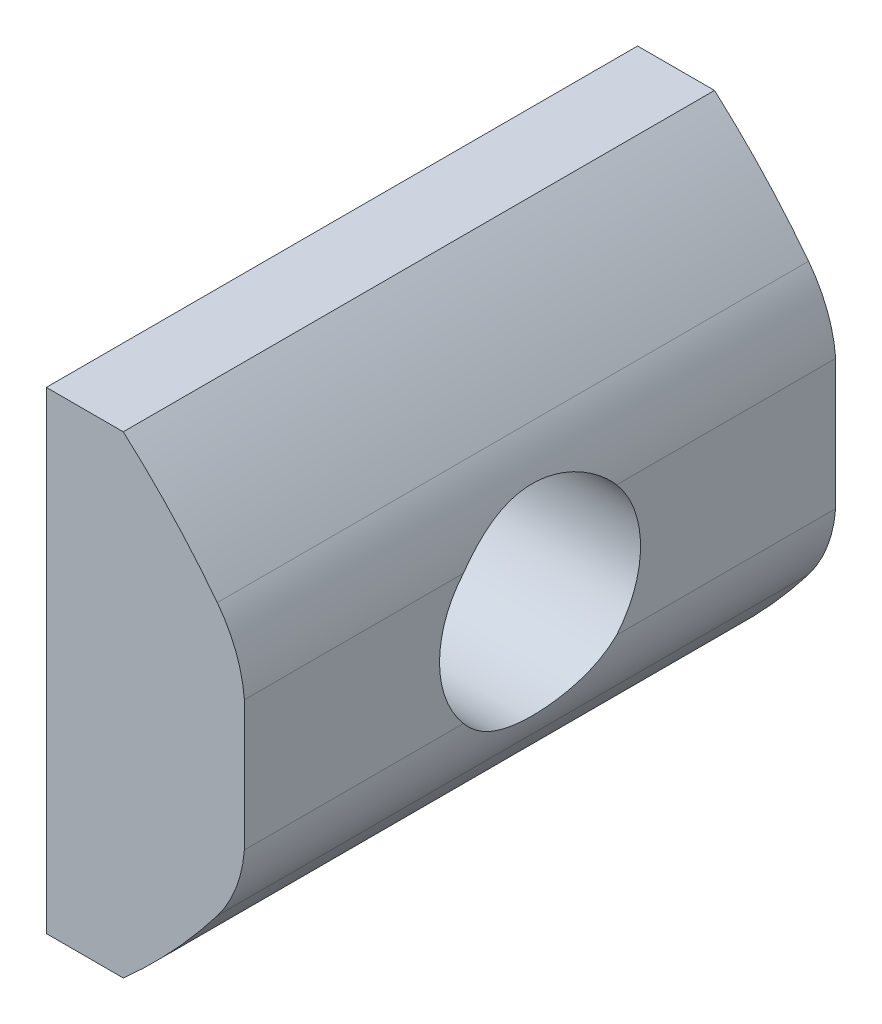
ISO-10303-21;
HEADER;
FILE_DESCRIPTION(('STEP AP214'),'2;1');
FILE_NAME('part.step','',(''),(''),'','','');
FILE_SCHEMA(('AUTOMOTIVE_DESIGN { 1 0 10303 214 1 1 1 1 }'));
ENDSEC;
DATA;
#1=APPLICATION_CONTEXT('core data for automotive mechanical design processes');
#2=APPLICATION_PROTOCOL_DEFINITION('international standard','automotive_design',2000,#1);
#3=PRODUCT_CONTEXT('',#1,'mechanical');
#4=PRODUCT('Part','Part','',(#3));
#5=PRODUCT_RELATED_PRODUCT_CATEGORY('part','',(#4));
#6=PRODUCT_DEFINITION_FORMATION('','',#4);
#7=PRODUCT_DEFINITION_CONTEXT('part definition',#1,'design');
#8=PRODUCT_DEFINITION('design','',#6,#7);
#9=PRODUCT_DEFINITION_SHAPE('','',#8);
#10=(LENGTH_UNIT() NAMED_UNIT(*) SI_UNIT(.MILLI.,.METRE.));
#11=(NAMED_UNIT(*) PLANE_ANGLE_UNIT() SI_UNIT($,.RADIAN.));
#12=(NAMED_UNIT(*) SI_UNIT($,.STERADIAN.) SOLID_ANGLE_UNIT());
#13=UNCERTAINTY_MEASURE_WITH_UNIT(LENGTH_MEASURE(1.E-05),#10,'distance_accuracy_value','');
#14=(GEOMETRIC_REPRESENTATION_CONTEXT(3) GLOBAL_UNCERTAINTY_ASSIGNED_CONTEXT((#13)) GLOBAL_UNIT_ASSIGNED_CONTEXT((#10,
#11,#12)) REPRESENTATION_CONTEXT('',''));
#15=CARTESIAN_POINT('',(0.,0.,0.));
#16=DIRECTION('',(0.,0.,1.));
#17=DIRECTION('',(1.,0.,0.));
#18=AXIS2_PLACEMENT_3D('',#15,#16,#17);
#19=CARTESIAN_POINT('',(4.,2.2,10.));
#20=DIRECTION('',(-1.,0.,0.));
#21=DIRECTION('',(0.,0.,1.));
#22=AXIS2_PLACEMENT_3D('',#19,#20,#21);
#23=PLANE('',#22);
#24=DIRECTION('',(0.,0.,-1.));
#25=VECTOR('',#24,1.);
#26=CARTESIAN_POINT('',(4.,2.2,10.));
#27=LINE('',#26,#25);
#28=CARTESIAN_POINT('',(4.,2.2,-2.59229627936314));
#29=VERTEX_POINT('',#28);
#30=CARTESIAN_POINT('',(4.,2.2,-10.));
#31=VERTEX_POINT('',#30);
#32=EDGE_CURVE('E144',#29,#31,#27,.T.);
#33=ORIENTED_EDGE('',*,*,#32,.F.);
#34=CARTESIAN_POINT('',(4.,0.,0.));
#35=DIRECTION('',(-1.,0.,0.));
#36=DIRECTION('',(0.,0.,1.));
#37=AXIS2_PLACEMENT_3D('',#34,#35,#36);
#38=CIRCLE('',#37,3.4);
#39=CARTESIAN_POINT('',(4.,-2.20000000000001,-2.59229627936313));
#40=VERTEX_POINT('',#39);
#41=EDGE_CURVE('E51',#29,#40,#38,.T.);
#42=ORIENTED_EDGE('',*,*,#41,.T.);
#43=DIRECTION('',(0.,0.,-1.));
#44=VECTOR('',#43,1.);
#45=CARTESIAN_POINT('',(4.,-2.2,10.));
#46=LINE('',#45,#44);
#47=CARTESIAN_POINT('',(4.,-2.2,-10.));
#48=VERTEX_POINT('',#47);
#49=EDGE_CURVE('E143',#40,#48,#46,.T.);
#50=ORIENTED_EDGE('',*,*,#49,.T.);
#51=DIRECTION('',(0.,1.,0.));
#52=VECTOR('',#51,1.);
#53=CARTESIAN_POINT('',(4.,2.2,-10.));
#54=LINE('',#53,#52);
#55=EDGE_CURVE('E221',#48,#31,#54,.T.);
#56=ORIENTED_EDGE('',*,*,#55,.T.);
#57=EDGE_LOOP('',(#33,#42,#50,#56));
#58=FACE_BOUND('',#57,.T.);
#59=ADVANCED_FACE('F31',(#58),#23,.F.);
#60=CARTESIAN_POINT('',(-3.,8.,10.));
#61=DIRECTION('',(0.,-1.,0.));
#62=DIRECTION('',(0.,0.,-1.));
#63=AXIS2_PLACEMENT_3D('',#60,#61,#62);
#64=PLANE('',#63);
#65=DIRECTION('',(-1.,0.,0.));
#66=VECTOR('',#65,1.);
#67=CARTESIAN_POINT('',(-3.,8.,-10.));
#68=LINE('',#67,#66);
#69=CARTESIAN_POINT('',(-0.0973372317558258,8.,-10.));
#70=VERTEX_POINT('',#69);
#71=CARTESIAN_POINT('',(-2.7,8.,-10.));
#72=VERTEX_POINT('',#71);
#73=EDGE_CURVE('E177',#70,#72,#68,.T.);
#74=ORIENTED_EDGE('',*,*,#73,.T.);
#75=DIRECTION('',(0.,0.,1.));
#76=VECTOR('',#75,1.);
#77=CARTESIAN_POINT('',(-2.7,8.,10.));
#78=LINE('',#77,#76);
#79=CARTESIAN_POINT('',(-2.7,8.,10.));
#80=VERTEX_POINT('',#79);
#81=EDGE_CURVE('E166',#72,#80,#78,.T.);
#82=ORIENTED_EDGE('',*,*,#81,.T.);
#83=DIRECTION('',(-1.,0.,0.));
#84=VECTOR('',#83,1.);
#85=CARTESIAN_POINT('',(-3.,8.,10.));
#86=LINE('',#85,#84);
#87=CARTESIAN_POINT('',(-0.0973372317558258,8.,10.));
#88=VERTEX_POINT('',#87);
#89=EDGE_CURVE('E228',#88,#80,#86,.T.);
#90=ORIENTED_EDGE('',*,*,#89,.F.);
#91=DIRECTION('',(0.,0.,-1.));
#92=VECTOR('',#91,1.);
#93=CARTESIAN_POINT('',(-0.0973372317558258,8.,10.));
#94=LINE('',#93,#92);
#95=EDGE_CURVE('E190',#88,#70,#94,.T.);
#96=ORIENTED_EDGE('',*,*,#95,.T.);
#97=EDGE_LOOP('',(#74,#82,#90,#96));
#98=FACE_BOUND('',#97,.T.);
#99=ADVANCED_FACE('F33',(#98),#64,.F.);
#100=CARTESIAN_POINT('',(-3.,8.,10.));
#101=DIRECTION('',(1.,0.,0.));
#102=DIRECTION('',(0.,0.,-1.));
#103=AXIS2_PLACEMENT_3D('',#100,#101,#102);
#104=PLANE('',#103);
#105=CARTESIAN_POINT('',(-3.,0.,0.));
#106=DIRECTION('',(-1.,0.,0.));
#107=DIRECTION('',(0.,0.,1.));
#108=AXIS2_PLACEMENT_3D('',#105,#106,#107);
#109=CIRCLE('',#108,3.39999999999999);
#110=CARTESIAN_POINT('',(-3.,0.,3.39999999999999));
#111=VERTEX_POINT('',#110);
#112=EDGE_CURVE('E138',#111,#111,#109,.T.);
#113=ORIENTED_EDGE('',*,*,#112,.F.);
#114=EDGE_LOOP('',(#113));
#115=FACE_BOUND('',#114,.T.);
#116=DIRECTION('',(0.,1.,0.));
#117=VECTOR('',#116,1.);
#118=CARTESIAN_POINT('',(-3.,8.,9.7));
#119=LINE('',#118,#117);
#120=CARTESIAN_POINT('',(-3.,-7.7,9.7));
#121=VERTEX_POINT('',#120);
#122=CARTESIAN_POINT('',(-3.,7.7,9.7));
#123=VERTEX_POINT('',#122);
#124=EDGE_CURVE('E161',#121,#123,#119,.T.);
#125=ORIENTED_EDGE('',*,*,#124,.T.);
#126=DIRECTION('',(0.,0.,-1.));
#127=VECTOR('',#126,1.);
#128=CARTESIAN_POINT('',(-3.,7.7,10.));
#129=LINE('',#128,#127);
#130=CARTESIAN_POINT('',(-3.,7.7,-9.7));
#131=VERTEX_POINT('',#130);
#132=EDGE_CURVE('E163',#123,#131,#129,.T.);
#133=ORIENTED_EDGE('',*,*,#132,.T.);
#134=DIRECTION('',(0.,-1.,0.));
#135=VECTOR('',#134,1.);
#136=CARTESIAN_POINT('',(-3.,8.,-9.7));
#137=LINE('',#136,#135);
#138=CARTESIAN_POINT('',(-3.,-7.7,-9.7));
#139=VERTEX_POINT('',#138);
#140=EDGE_CURVE('E157',#131,#139,#137,.T.);
#141=ORIENTED_EDGE('',*,*,#140,.T.);
#142=DIRECTION('',(0.,0.,1.));
#143=VECTOR('',#142,1.);
#144=CARTESIAN_POINT('',(-3.,-7.7,10.));
#145=LINE('',#144,#143);
#146=EDGE_CURVE('E159',#139,#121,#145,.T.);
#147=ORIENTED_EDGE('',*,*,#146,.T.);
#148=EDGE_LOOP('',(#125,#133,#141,#147));
#149=FACE_BOUND('',#148,.T.);
#150=ADVANCED_FACE('F267',(#115,#149),#104,.F.);
#151=CARTESIAN_POINT('',(-3.,-8.,10.));
#152=DIRECTION('',(0.,1.,0.));
#153=DIRECTION('',(0.,0.,1.));
#154=AXIS2_PLACEMENT_3D('',#151,#152,#153);
#155=PLANE('',#154);
#156=DIRECTION('',(1.,0.,0.));
#157=VECTOR('',#156,1.);
#158=CARTESIAN_POINT('',(-3.,-8.,10.));
#159=LINE('',#158,#157);
#160=CARTESIAN_POINT('',(-2.7,-8.,10.));
#161=VERTEX_POINT('',#160);
#162=CARTESIAN_POINT('',(-0.0973372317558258,-8.,10.));
#163=VERTEX_POINT('',#162);
#164=EDGE_CURVE('E230',#161,#163,#159,.T.);
#165=ORIENTED_EDGE('',*,*,#164,.F.);
#166=DIRECTION('',(0.,0.,-1.));
#167=VECTOR('',#166,1.);
#168=CARTESIAN_POINT('',(-2.7,-8.,10.));
#169=LINE('',#168,#167);
#170=CARTESIAN_POINT('',(-2.7,-8.,-10.));
#171=VERTEX_POINT('',#170);
#172=EDGE_CURVE('E58',#161,#171,#169,.T.);
#173=ORIENTED_EDGE('',*,*,#172,.T.);
#174=DIRECTION('',(1.,0.,0.));
#175=VECTOR('',#174,1.);
#176=CARTESIAN_POINT('',(-3.,-8.,-10.));
#177=LINE('',#176,#175);
#178=CARTESIAN_POINT('',(-0.0973372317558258,-8.,-10.));
#179=VERTEX_POINT('',#178);
#180=EDGE_CURVE('E179',#171,#179,#177,.T.);
#181=ORIENTED_EDGE('',*,*,#180,.T.);
#182=DIRECTION('',(0.,0.,-1.));
#183=VECTOR('',#182,1.);
#184=CARTESIAN_POINT('',(-0.0973372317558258,-8.,10.));
#185=LINE('',#184,#183);
#186=EDGE_CURVE('E154',#163,#179,#185,.T.);
#187=ORIENTED_EDGE('',*,*,#186,.F.);
#188=EDGE_LOOP('',(#165,#173,#181,#187));
#189=FACE_BOUND('',#188,.T.);
#190=ADVANCED_FACE('F257',(#189),#155,.F.);
#191=CARTESIAN_POINT('',(-16.3500000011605,10.3330562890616,10.));
#192=DIRECTION('',(0.,0.,-1.));
#193=DIRECTION('',(-1.,0.,0.));
#194=AXIS2_PLACEMENT_3D('',#191,#192,#193);
#195=CYLINDRICAL_SURFACE('',#194,24.4999999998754);
#196=CARTESIAN_POINT('',(-16.3500000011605,10.3330562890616,-10.));
#197=DIRECTION('',(0.,0.,1.));
#198=DIRECTION('',(-1.,0.,0.));
#199=AXIS2_PLACEMENT_3D('',#196,#197,#198);
#200=CIRCLE('',#199,24.4999999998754);
#201=CARTESIAN_POINT('',(3.08330765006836,-4.58661373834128,-10.));
#202=VERTEX_POINT('',#201);
#203=EDGE_CURVE('E216',#179,#202,#200,.T.);
#204=ORIENTED_EDGE('',*,*,#203,.T.);
#205=DIRECTION('',(0.,0.,-1.));
#206=VECTOR('',#205,1.);
#207=CARTESIAN_POINT('',(3.08330765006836,-4.58661373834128,10.));
#208=LINE('',#207,#206);
#209=CARTESIAN_POINT('',(3.08330765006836,-4.58661373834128,10.));
#210=VERTEX_POINT('',#209);
#211=EDGE_CURVE('E151',#210,#202,#208,.T.);
#212=ORIENTED_EDGE('',*,*,#211,.F.);
#213=CARTESIAN_POINT('',(-16.3500000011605,10.3330562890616,10.));
#214=DIRECTION('',(0.,0.,1.));
#215=DIRECTION('',(-1.,0.,0.));
#216=AXIS2_PLACEMENT_3D('',#213,#214,#215);
#217=CIRCLE('',#216,24.4999999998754);
#218=EDGE_CURVE('E232',#163,#210,#217,.T.);
#219=ORIENTED_EDGE('',*,*,#218,.F.);
#220=ORIENTED_EDGE('',*,*,#186,.T.);
#221=EDGE_LOOP('',(#204,#212,#219,#220));
#222=FACE_BOUND('',#221,.T.);
#223=ADVANCED_FACE('F254',(#222),#195,.T.);
#224=CARTESIAN_POINT('',(-0.486075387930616,-1.84626618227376,10.));
#225=DIRECTION('',(0.,0.,-1.));
#226=DIRECTION('',(-1.,0.,0.));
#227=AXIS2_PLACEMENT_3D('',#224,#225,#226);
#228=CYLINDRICAL_SURFACE('',#227,4.5);
#229=ORIENTED_EDGE('',*,*,#49,.F.);
#230=CARTESIAN_POINT('',(-3.71669234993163,1.28632284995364,-3.14728033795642));
#231=CARTESIAN_POINT('',(-3.62037329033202,1.38562200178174,-3.10669729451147));
#232=CARTESIAN_POINT('',(-3.52027985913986,1.47971882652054,-3.06275604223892));
#233=CARTESIAN_POINT('',(-3.31321734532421,1.65743533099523,-2.97034132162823));
#234=CARTESIAN_POINT('',(-3.20625227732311,1.74106104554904,-2.92187049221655));
#235=CARTESIAN_POINT('',(-2.9848454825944,1.89870461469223,-2.82200509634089));
#236=CARTESIAN_POINT('',(-2.87033681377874,1.97261186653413,-2.77058509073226));
#237=CARTESIAN_POINT('',(-2.63516193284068,2.10973558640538,-2.66765352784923));
#238=CARTESIAN_POINT('',(-2.51449597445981,2.17295249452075,-2.61614197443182));
#239=CARTESIAN_POINT('',(-2.20617777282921,2.31700431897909,-2.49087829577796));
#240=CARTESIAN_POINT('',(-2.01474384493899,2.39123348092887,-2.4186345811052));
#241=CARTESIAN_POINT('',(-1.6190398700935,2.51365890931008,-2.29114569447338));
#242=CARTESIAN_POINT('',(-1.41483937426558,2.5619844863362,-2.23581669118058));
#243=CARTESIAN_POINT('',(-1.04483478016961,2.62184778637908,-2.16509013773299));
#244=CARTESIAN_POINT('',(-0.881299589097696,2.63936555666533,-2.14336059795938));
#245=CARTESIAN_POINT('',(-0.634405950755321,2.65204720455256,-2.12759476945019));
#246=CARTESIAN_POINT('',(-0.551860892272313,2.65400962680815,-2.12514295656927));
#247=CARTESIAN_POINT('',(-0.386812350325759,2.65339574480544,-2.12590964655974));
#248=CARTESIAN_POINT('',(-0.304308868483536,2.65081927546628,-2.12912835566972));
#249=CARTESIAN_POINT('',(-0.0583578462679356,2.63635494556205,-2.14707377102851));
#250=CARTESIAN_POINT('',(0.104169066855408,2.61776415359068,-2.17005075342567));
#251=CARTESIAN_POINT('',(0.423095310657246,2.56392204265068,-2.23337151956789));
#252=CARTESIAN_POINT('',(0.579477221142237,2.52862660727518,-2.27376126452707));
#253=CARTESIAN_POINT('',(0.854232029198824,2.45137367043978,-2.3565464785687));
#254=CARTESIAN_POINT('',(0.97399937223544,2.41211944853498,-2.39696096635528));
#255=CARTESIAN_POINT('',(1.20853548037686,2.3243432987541,-2.48217017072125));
#256=CARTESIAN_POINT('',(1.32330131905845,2.27581603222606,-2.52696740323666));
#257=CARTESIAN_POINT('',(1.54803769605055,2.16968492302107,-2.6186638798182));
#258=CARTESIAN_POINT('',(1.6579961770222,2.11205976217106,-2.66556787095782));
#259=CARTESIAN_POINT('',(1.87276732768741,1.98795322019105,-2.75936471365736));
#260=CARTESIAN_POINT('',(1.97758101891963,1.92147360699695,-2.80625756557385));
#261=CARTESIAN_POINT('',(2.18564710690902,1.77706324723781,-2.89995263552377));
#262=CARTESIAN_POINT('',(2.28870059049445,1.69880147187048,-2.9466881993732));
#263=CARTESIAN_POINT('',(2.48866870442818,1.53275592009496,-3.03637429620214));
#264=CARTESIAN_POINT('',(2.58558200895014,1.44497009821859,-3.0793240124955));
#265=CARTESIAN_POINT('',(2.77225060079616,1.26025578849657,-3.15940607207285));
#266=CARTESIAN_POINT('',(2.86202873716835,1.1633588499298,-3.19655738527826));
#267=CARTESIAN_POINT('',(3.03377785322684,0.960564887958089,-3.26323734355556));
#268=CARTESIAN_POINT('',(3.11575404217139,0.854673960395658,-3.29277109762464));
#269=CARTESIAN_POINT('',(3.29260250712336,0.603471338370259,-3.34912461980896));
#270=CARTESIAN_POINT('',(3.38467517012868,0.455413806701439,-3.37287860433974));
#271=CARTESIAN_POINT('',(3.5098122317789,0.225101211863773,-3.3934194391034));
#272=CARTESIAN_POINT('',(3.5493697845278,0.146941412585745,-3.39775066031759));
#273=CARTESIAN_POINT('',(3.62388600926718,-0.0116347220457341,-3.40090303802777));
#274=CARTESIAN_POINT('',(3.65884683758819,-0.0920499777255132,-3.39972678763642));
#275=CARTESIAN_POINT('',(3.72415212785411,-0.25511644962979,-3.39140535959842));
#276=CARTESIAN_POINT('',(3.75446117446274,-0.337779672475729,-3.38421684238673));
#277=CARTESIAN_POINT('',(3.80996446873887,-0.503987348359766,-3.36348115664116));
#278=CARTESIAN_POINT('',(3.83516098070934,-0.587531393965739,-3.34993681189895));
#279=CARTESIAN_POINT('',(3.88038418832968,-0.754694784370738,-3.316278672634));
#280=CARTESIAN_POINT('',(3.90041107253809,-0.838314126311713,-3.29616511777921));
#281=CARTESIAN_POINT('',(3.93535895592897,-1.00475044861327,-3.24929995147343));
#282=CARTESIAN_POINT('',(3.95028034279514,-1.08756748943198,-3.22254884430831));
#283=CARTESIAN_POINT('',(3.97396573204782,-1.24327745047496,-3.1655055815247));
#284=CARTESIAN_POINT('',(3.98319844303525,-1.31632998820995,-3.13584119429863));
#285=CARTESIAN_POINT('',(3.99794694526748,-1.46051257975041,-3.07134378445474));
#286=CARTESIAN_POINT('',(4.0034614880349,-1.53164198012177,-3.03650903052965));
#287=CARTESIAN_POINT('',(4.01486901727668,-1.74127302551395,-2.92455007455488));
#288=CARTESIAN_POINT('',(4.01564457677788,-1.87614870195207,-2.8399232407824));
#289=CARTESIAN_POINT('',(4.00652580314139,-2.13607721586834,-2.65025592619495));
#290=CARTESIAN_POINT('',(3.99632513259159,-2.2607379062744,-2.54470004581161));
#291=CARTESIAN_POINT('',(3.96870438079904,-2.49330681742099,-2.31730147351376));
#292=CARTESIAN_POINT('',(3.95128063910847,-2.60120650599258,-2.19545054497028));
#293=CARTESIAN_POINT('',(3.91088560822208,-2.81033590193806,-1.9222675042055));
#294=CARTESIAN_POINT('',(3.88749725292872,-2.90915601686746,-1.76915225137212));
#295=CARTESIAN_POINT('',(3.84206984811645,-3.08122447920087,-1.44881939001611));
#296=CARTESIAN_POINT('',(3.82003127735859,-3.15446379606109,-1.28159682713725));
#297=CARTESIAN_POINT('',(3.7910254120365,-3.24536470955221,-1.01829542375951));
#298=CARTESIAN_POINT('',(3.78184705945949,-3.2729595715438,-0.925781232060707));
#299=CARTESIAN_POINT('',(3.76576008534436,-3.32021495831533,-0.738565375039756));
#300=CARTESIAN_POINT('',(3.7588505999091,-3.3398785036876,-0.643864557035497));
#301=CARTESIAN_POINT('',(3.74774538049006,-3.37107289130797,-0.453008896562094));
#302=CARTESIAN_POINT('',(3.74354877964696,-3.38260633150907,-0.356854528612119));
#303=CARTESIAN_POINT('',(3.73813521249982,-3.39742950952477,-0.163831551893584));
#304=CARTESIAN_POINT('',(3.73691805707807,-3.40071977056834,-0.0669629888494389));
#305=CARTESIAN_POINT('',(3.73752731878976,-3.39906432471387,0.121409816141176));
#306=CARTESIAN_POINT('',(3.73919135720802,-3.39455802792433,0.212918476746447));
#307=CARTESIAN_POINT('',(3.74514863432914,-3.37819574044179,0.395198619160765));
#308=CARTESIAN_POINT('',(3.74944277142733,-3.36633723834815,0.48596983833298));
#309=CARTESIAN_POINT('',(3.76594174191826,-3.3198709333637,0.756160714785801));
#310=CARTESIAN_POINT('',(3.78176424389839,-3.27437076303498,0.933611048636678));
#311=CARTESIAN_POINT('',(3.81955128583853,-3.15598479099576,1.27784261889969));
#312=CARTESIAN_POINT('',(3.8415026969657,-3.08315741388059,1.44464573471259));
#313=CARTESIAN_POINT('',(3.88680736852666,-2.91197807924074,1.76445857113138));
#314=CARTESIAN_POINT('',(3.91016132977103,-2.81361327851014,1.91746129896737));
#315=CARTESIAN_POINT('',(3.95416204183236,-2.58677182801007,2.21484388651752));
#316=CARTESIAN_POINT('',(3.97456738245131,-2.45685966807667,2.35818049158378));
#317=CARTESIAN_POINT('',(3.99680440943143,-2.24483725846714,2.55539977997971));
#318=CARTESIAN_POINT('',(4.00282230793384,-2.17127168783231,2.61819652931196));
#319=CARTESIAN_POINT('',(4.01125605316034,-2.01894120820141,2.73737215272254));
#320=CARTESIAN_POINT('',(4.01367395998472,-1.94017929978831,2.79375468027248));
#321=CARTESIAN_POINT('',(4.01412577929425,-1.78251661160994,2.8967252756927));
#322=CARTESIAN_POINT('',(4.01239025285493,-1.70385484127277,2.94367861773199));
#323=CARTESIAN_POINT('',(4.00442761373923,-1.54320838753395,3.03098291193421));
#324=CARTESIAN_POINT('',(3.99820289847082,-1.46122549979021,3.07133737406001));
#325=CARTESIAN_POINT('',(3.98078615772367,-1.2947729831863,3.1451304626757));
#326=CARTESIAN_POINT('',(3.96959732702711,-1.21030498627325,3.1785735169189));
#327=CARTESIAN_POINT('',(3.9419036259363,-1.03975312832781,3.23837579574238));
#328=CARTESIAN_POINT('',(3.92539935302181,-0.953669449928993,3.2647358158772));
#329=CARTESIAN_POINT('',(3.88920352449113,-0.791281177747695,3.30757454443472));
#330=CARTESIAN_POINT('',(3.87013647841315,-0.715049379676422,3.32486158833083));
#331=CARTESIAN_POINT('',(3.82771742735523,-0.562732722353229,3.35400604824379));
#332=CARTESIAN_POINT('',(3.80436409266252,-0.486647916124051,3.36586177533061));
#333=CARTESIAN_POINT('',(3.72794599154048,-0.259631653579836,3.39348706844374));
#334=CARTESIAN_POINT('',(3.66848945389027,-0.109785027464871,3.4013540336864));
#335=CARTESIAN_POINT('',(3.5339756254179,0.182309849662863,3.39825920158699));
#336=CARTESIAN_POINT('',(3.45891843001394,0.324558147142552,3.38729751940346));
#337=CARTESIAN_POINT('',(3.2951478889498,0.598705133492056,3.34973334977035));
#338=CARTESIAN_POINT('',(3.20642750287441,0.730598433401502,3.32312277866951));
#339=CARTESIAN_POINT('',(2.97188150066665,1.04282049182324,3.24185163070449));
#340=CARTESIAN_POINT('',(2.81908820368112,1.21600545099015,3.17985797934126));
#341=CARTESIAN_POINT('',(2.49295546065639,1.53420238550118,3.03917386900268));
#342=CARTESIAN_POINT('',(2.31956927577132,1.67914822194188,2.96044509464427));
#343=CARTESIAN_POINT('',(2.04440947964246,1.87660784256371,2.83629913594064));
#344=CARTESIAN_POINT('',(1.94893122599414,1.93973487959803,2.79335301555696));
#345=CARTESIAN_POINT('',(1.75359623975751,2.05846635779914,2.70704577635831));
#346=CARTESIAN_POINT('',(1.653740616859,2.11407269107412,2.66368476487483));
#347=CARTESIAN_POINT('',(1.44972888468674,2.21769051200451,2.57805421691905));
#348=CARTESIAN_POINT('',(1.3455735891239,2.26570342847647,2.53578447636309));
#349=CARTESIAN_POINT('',(1.13300571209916,2.35395176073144,2.45408385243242));
#350=CARTESIAN_POINT('',(1.0245943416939,2.39418936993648,2.41465217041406));
#351=CARTESIAN_POINT('',(0.74925426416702,2.48431613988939,2.32252195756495));
#352=CARTESIAN_POINT('',(0.579614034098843,2.52931574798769,2.2727542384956));
#353=CARTESIAN_POINT('',(0.319172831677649,2.58198451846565,2.21225577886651));
#354=CARTESIAN_POINT('',(0.231457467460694,2.59706092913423,2.19445975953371));
#355=CARTESIAN_POINT('',(0.0543585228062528,2.62205748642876,2.16453129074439));
#356=CARTESIAN_POINT('',(-0.0350240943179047,2.63198052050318,2.15239567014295));
#357=CARTESIAN_POINT('',(-0.215849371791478,2.64653833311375,2.13447251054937));
#358=CARTESIAN_POINT('',(-0.307303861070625,2.65111457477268,2.12875526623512));
#359=CARTESIAN_POINT('',(-0.49048945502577,2.65466398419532,2.12432760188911));
#360=CARTESIAN_POINT('',(-0.582220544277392,2.65363745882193,2.1256167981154));
#361=CARTESIAN_POINT('',(-0.765197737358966,2.64600312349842,2.1351119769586));
#362=CARTESIAN_POINT('',(-0.85644312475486,2.63938859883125,2.14332628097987));
#363=CARTESIAN_POINT('',(-1.03759534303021,2.6207391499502,2.16608853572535));
#364=CARTESIAN_POINT('',(-1.1275013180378,2.60870090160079,2.18064037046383));
#365=CARTESIAN_POINT('',(-1.43024998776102,2.55889023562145,2.23942870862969));
#366=CARTESIAN_POINT('',(-1.63867745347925,2.50870423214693,2.29667541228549));
#367=CARTESIAN_POINT('',(-1.94049992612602,2.41353485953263,2.3951923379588));
#368=CARTESIAN_POINT('',(-2.03949578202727,2.37840423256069,2.43022388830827));
#369=CARTESIAN_POINT('',(-2.23397115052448,2.30171600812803,2.50297735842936));
#370=CARTESIAN_POINT('',(-2.32945149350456,2.26015994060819,2.54069863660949));
#371=CARTESIAN_POINT('',(-2.52154997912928,2.16854805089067,2.61939380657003));
#372=CARTESIAN_POINT('',(-2.61798635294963,2.11817115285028,2.66043602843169));
#373=CARTESIAN_POINT('',(-2.80693455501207,2.01060316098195,2.742639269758));
#374=CARTESIAN_POINT('',(-2.89944487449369,1.95340947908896,2.78380032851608));
#375=CARTESIAN_POINT('',(-3.17033409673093,1.77199877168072,2.90535810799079));
#376=CARTESIAN_POINT('',(-3.34288594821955,1.63756380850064,2.98418338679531));
#377=CARTESIAN_POINT('',(-3.54208178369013,1.4572451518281,3.07209392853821));
#378=CARTESIAN_POINT('',(-3.57766078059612,1.42397608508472,3.0876654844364));
#379=CARTESIAN_POINT('',(-3.64788336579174,1.35613176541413,3.11805770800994));
#380=CARTESIAN_POINT('',(-3.68252692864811,1.3215564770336,3.13287835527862));
#381=CARTESIAN_POINT('',(-3.71669234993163,1.28632284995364,3.14728033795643));
#382=B_SPLINE_CURVE_WITH_KNOTS('',3,(#230,#231,#232,#233,#234,#235,#236,#237,#238,#239,#240,
#241,#242,#243,#244,#245,#246,#247,#248,#249,#250,#251,#252,#253,#254,#255,#256,#257,#258,#259,
#260,#261,#262,#263,#264,#265,#266,#267,#268,#269,#270,#271,#272,#273,#274,#275,#276,#277,#278,
#279,#280,#281,#282,#283,#284,#285,#286,#287,#288,#289,#290,#291,#292,#293,#294,#295,#296,#297,
#298,#299,#300,#301,#302,#303,#304,#305,#306,#307,#308,#309,#310,#311,#312,#313,#314,#315,#316,
#317,#318,#319,#320,#321,#322,#323,#324,#325,#326,#327,#328,#329,#330,#331,#332,#333,#334,#335,
#336,#337,#338,#339,#340,#341,#342,#343,#344,#345,#346,#347,#348,#349,#350,#351,#352,#353,#354,
#355,#356,#357,#358,#359,#360,#361,#362,#363,#364,#365,#366,#367,#368,#369,#370,#371,#372,#373,
#374,#375,#376,#377,#378,#379,#380,#381),.UNSPECIFIED.,.F.,.F.,(4,2,2,2,2,2,2,2,2,2,2,2,2,2,2,2,
2,2,2,2,2,2,2,2,2,2,2,2,2,2,2,2,2,2,2,2,2,2,2,2,2,2,2,2,2,2,2,2,2,2,2,2,2,2,2,2,2,2,2,2,2,2,2,2,
2,2,2,2,2,2,2,2,2,2,2,4),(0.,0.432157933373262,0.864065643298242,1.30052739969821,
1.73697118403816,2.38786389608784,3.0354763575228,3.53073034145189,3.77825065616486,
4.02577997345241,4.51894338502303,5.01341655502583,5.409972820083,5.8067580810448,
6.20448727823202,6.60213718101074,7.01439978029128,7.42675109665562,7.83772374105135,
8.2484200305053,8.77390679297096,9.03676447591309,9.29949840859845,9.56414275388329,
9.82866963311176,10.093186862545,10.3576840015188,10.5955487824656,10.8334933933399,
11.3089650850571,11.7980594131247,12.2874019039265,12.8362938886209,13.3853794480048,
13.6759950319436,13.9664998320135,14.2569117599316,14.5473052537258,14.8218604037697,
15.0965093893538,15.6453529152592,16.1930296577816,16.7409823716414,17.3213033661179,
17.6116930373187,17.901916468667,18.1764061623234,18.4507493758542,18.7249162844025,
18.9990523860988,19.2401246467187,19.481271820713,19.9630870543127,20.4448993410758,
20.9269607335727,21.6404399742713,22.3555706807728,22.7220738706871,23.0884846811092,
23.4548264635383,23.8210647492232,24.3662393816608,24.6382563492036,24.9101207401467,
25.1849344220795,25.4597330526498,25.7348623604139,26.0101605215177,26.6715395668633,
27.0035913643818,27.3355642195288,27.684134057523,28.0328366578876,28.7273544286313,
28.8807542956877,29.0341583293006),.UNSPECIFIED.);
#383=CARTESIAN_POINT('',(4.,-2.20000000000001,2.59229627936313));
#384=VERTEX_POINT('',#383);
#385=EDGE_CURVE('E202',#40,#384,#382,.T.);
#386=ORIENTED_EDGE('',*,*,#385,.T.);
#387=CARTESIAN_POINT('',(4.,-2.2,10.));
#388=VERTEX_POINT('',#387);
#389=EDGE_CURVE('E137',#388,#384,#46,.T.);
#390=ORIENTED_EDGE('',*,*,#389,.F.);
#391=CARTESIAN_POINT('',(-0.486075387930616,-1.84626618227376,10.));
#392=DIRECTION('',(0.,0.,1.));
#393=DIRECTION('',(-1.,0.,0.));
#394=AXIS2_PLACEMENT_3D('',#391,#392,#393);
#395=CIRCLE('',#394,4.5);
#396=EDGE_CURVE('E234',#210,#388,#395,.T.);
#397=ORIENTED_EDGE('',*,*,#396,.F.);
#398=ORIENTED_EDGE('',*,*,#211,.T.);
#399=CARTESIAN_POINT('',(-0.486075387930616,-1.84626618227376,-10.));
#400=DIRECTION('',(0.,0.,1.));
#401=DIRECTION('',(-1.,0.,0.));
#402=AXIS2_PLACEMENT_3D('',#399,#400,#401);
#403=CIRCLE('',#402,4.5);
#404=EDGE_CURVE('E218',#202,#48,#403,.T.);
#405=ORIENTED_EDGE('',*,*,#404,.T.);
#406=EDGE_LOOP('',(#229,#386,#390,#397,#398,#405));
#407=FACE_BOUND('',#406,.T.);
#408=ADVANCED_FACE('F250',(#407),#228,.T.);
#409=ORIENTED_EDGE('',*,*,#389,.T.);
#410=CARTESIAN_POINT('',(4.,2.20000000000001,2.59229627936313));
#411=VERTEX_POINT('',#410);
#412=EDGE_CURVE('E124',#384,#411,#38,.T.);
#413=ORIENTED_EDGE('',*,*,#412,.T.);
#414=CARTESIAN_POINT('',(4.,2.2,10.));
#415=VERTEX_POINT('',#414);
#416=EDGE_CURVE('E134',#415,#411,#27,.T.);
#417=ORIENTED_EDGE('',*,*,#416,.F.);
#418=DIRECTION('',(0.,1.,0.));
#419=VECTOR('',#418,1.);
#420=CARTESIAN_POINT('',(4.,2.2,10.));
#421=LINE('',#420,#419);
#422=EDGE_CURVE('E236',#388,#415,#421,.T.);
#423=ORIENTED_EDGE('',*,*,#422,.F.);
#424=EDGE_LOOP('',(#409,#413,#417,#423));
#425=FACE_BOUND('',#424,.T.);
#426=ADVANCED_FACE('F132',(#425),#23,.F.);
#427=CARTESIAN_POINT('',(-0.486075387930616,1.84626618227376,10.));
#428=DIRECTION('',(0.,0.,-1.));
#429=DIRECTION('',(-1.,0.,0.));
#430=AXIS2_PLACEMENT_3D('',#427,#428,#429);
#431=CYLINDRICAL_SURFACE('',#430,4.5);
#432=ORIENTED_EDGE('',*,*,#416,.T.);
#433=CARTESIAN_POINT('',(-3.71669234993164,-1.28632284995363,3.14728033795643));
#434=CARTESIAN_POINT('',(-3.62037329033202,-1.38562200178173,3.10669729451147));
#435=CARTESIAN_POINT('',(-3.52027985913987,-1.47971882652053,3.06275604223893));
#436=CARTESIAN_POINT('',(-3.31321734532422,-1.65743533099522,2.97034132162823));
#437=CARTESIAN_POINT('',(-3.20625227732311,-1.74106104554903,2.92187049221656));
#438=CARTESIAN_POINT('',(-2.98484548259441,-1.89870461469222,2.82200509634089));
#439=CARTESIAN_POINT('',(-2.87033681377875,-1.97261186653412,2.77058509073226));
#440=CARTESIAN_POINT('',(-2.63516193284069,-2.10973558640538,2.66765352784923));
#441=CARTESIAN_POINT('',(-2.51449597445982,-2.17295249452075,2.61614197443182));
#442=CARTESIAN_POINT('',(-2.20617777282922,-2.31700431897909,2.49087829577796));
#443=CARTESIAN_POINT('',(-2.014743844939,-2.39123348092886,2.41863458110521));
#444=CARTESIAN_POINT('',(-1.6190398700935,-2.51365890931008,2.29114569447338));
#445=CARTESIAN_POINT('',(-1.41483937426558,-2.5619844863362,2.23581669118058));
#446=CARTESIAN_POINT('',(-1.04483478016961,-2.62184778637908,2.16509013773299));
#447=CARTESIAN_POINT('',(-0.8812995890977,-2.63936555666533,2.14336059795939));
#448=CARTESIAN_POINT('',(-0.634405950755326,-2.65204720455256,2.1275947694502));
#449=CARTESIAN_POINT('',(-0.551860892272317,-2.65400962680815,2.12514295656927));
#450=CARTESIAN_POINT('',(-0.386812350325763,-2.65339574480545,2.12590964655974));
#451=CARTESIAN_POINT('',(-0.30430886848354,-2.65081927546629,2.12912835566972));
#452=CARTESIAN_POINT('',(-0.0583578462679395,-2.63635494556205,2.14707377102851));
#453=CARTESIAN_POINT('',(0.104169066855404,-2.61776415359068,2.17005075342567));
#454=CARTESIAN_POINT('',(0.423095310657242,-2.56392204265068,2.23337151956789));
#455=CARTESIAN_POINT('',(0.579477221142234,-2.52862660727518,2.27376126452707));
#456=CARTESIAN_POINT('',(0.854232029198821,-2.45137367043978,2.3565464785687));
#457=CARTESIAN_POINT('',(0.973999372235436,-2.41211944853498,2.39696096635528));
#458=CARTESIAN_POINT('',(1.20853548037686,-2.3243432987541,2.48217017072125));
#459=CARTESIAN_POINT('',(1.32330131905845,-2.27581603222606,2.52696740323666));
#460=CARTESIAN_POINT('',(1.54803769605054,-2.16968492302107,2.6186638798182));
#461=CARTESIAN_POINT('',(1.6579961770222,-2.11205976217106,2.66556787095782));
#462=CARTESIAN_POINT('',(1.87276732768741,-1.98795322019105,2.75936471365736));
#463=CARTESIAN_POINT('',(1.97758101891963,-1.92147360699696,2.80625756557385));
#464=CARTESIAN_POINT('',(2.18564710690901,-1.77706324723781,2.89995263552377));
#465=CARTESIAN_POINT('',(2.28870059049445,-1.69880147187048,2.9466881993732));
#466=CARTESIAN_POINT('',(2.48866870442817,-1.53275592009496,3.03637429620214));
#467=CARTESIAN_POINT('',(2.58558200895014,-1.44497009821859,3.0793240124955));
#468=CARTESIAN_POINT('',(2.77225060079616,-1.26025578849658,3.15940607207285));
#469=CARTESIAN_POINT('',(2.86202873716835,-1.16335884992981,3.19655738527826));
#470=CARTESIAN_POINT('',(3.03377785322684,-0.960564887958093,3.26323734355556));
#471=CARTESIAN_POINT('',(3.11575404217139,-0.854673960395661,3.29277109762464));
#472=CARTESIAN_POINT('',(3.29260250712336,-0.603471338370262,3.34912461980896));
#473=CARTESIAN_POINT('',(3.38467517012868,-0.455413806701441,3.37287860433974));
#474=CARTESIAN_POINT('',(3.50981223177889,-0.225101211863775,3.3934194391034));
#475=CARTESIAN_POINT('',(3.5493697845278,-0.146941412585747,3.39775066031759));
#476=CARTESIAN_POINT('',(3.62388600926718,0.0116347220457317,3.40090303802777));
#477=CARTESIAN_POINT('',(3.65884683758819,0.0920499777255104,3.39972678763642));
#478=CARTESIAN_POINT('',(3.72415212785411,0.255116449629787,3.39140535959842));
#479=CARTESIAN_POINT('',(3.75446117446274,0.337779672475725,3.38421684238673));
#480=CARTESIAN_POINT('',(3.80996446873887,0.503987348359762,3.36348115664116));
#481=CARTESIAN_POINT('',(3.83516098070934,0.587531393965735,3.34993681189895));
#482=CARTESIAN_POINT('',(3.88038418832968,0.754694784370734,3.316278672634));
#483=CARTESIAN_POINT('',(3.90041107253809,0.838314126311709,3.29616511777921));
#484=CARTESIAN_POINT('',(3.93535895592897,1.00475044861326,3.24929995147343));
#485=CARTESIAN_POINT('',(3.95028034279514,1.08756748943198,3.22254884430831));
#486=CARTESIAN_POINT('',(3.97396573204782,1.24327745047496,3.1655055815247));
#487=CARTESIAN_POINT('',(3.98319844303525,1.31632998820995,3.13584119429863));
#488=CARTESIAN_POINT('',(3.99794694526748,1.46051257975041,3.07134378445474));
#489=CARTESIAN_POINT('',(4.0034614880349,1.53164198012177,3.03650903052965));
#490=CARTESIAN_POINT('',(4.01486901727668,1.74127302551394,2.92455007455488));
#491=CARTESIAN_POINT('',(4.01564457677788,1.87614870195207,2.8399232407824));
#492=CARTESIAN_POINT('',(4.00652580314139,2.13607721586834,2.65025592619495));
#493=CARTESIAN_POINT('',(3.99632513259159,2.2607379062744,2.54470004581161));
#494=CARTESIAN_POINT('',(3.96870438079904,2.49330681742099,2.31730147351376));
#495=CARTESIAN_POINT('',(3.95128063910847,2.60120650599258,2.19545054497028));
#496=CARTESIAN_POINT('',(3.91088560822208,2.81033590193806,1.9222675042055));
#497=CARTESIAN_POINT('',(3.88749725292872,2.90915601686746,1.76915225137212));
#498=CARTESIAN_POINT('',(3.84206984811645,3.08122447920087,1.44881939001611));
#499=CARTESIAN_POINT('',(3.82003127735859,3.15446379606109,1.28159682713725));
#500=CARTESIAN_POINT('',(3.7910254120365,3.24536470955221,1.01829542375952));
#501=CARTESIAN_POINT('',(3.78184705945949,3.2729595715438,0.925781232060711));
#502=CARTESIAN_POINT('',(3.76576008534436,3.32021495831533,0.73856537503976));
#503=CARTESIAN_POINT('',(3.7588505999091,3.3398785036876,0.643864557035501));
#504=CARTESIAN_POINT('',(3.74774538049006,3.37107289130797,0.453008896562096));
#505=CARTESIAN_POINT('',(3.74354877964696,3.38260633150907,0.356854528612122));
#506=CARTESIAN_POINT('',(3.73813521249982,3.39742950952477,0.163831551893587));
#507=CARTESIAN_POINT('',(3.73691805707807,3.40071977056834,0.066962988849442));
#508=CARTESIAN_POINT('',(3.73752731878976,3.39906432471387,-0.121409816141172));
#509=CARTESIAN_POINT('',(3.73919135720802,3.39455802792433,-0.212918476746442));
#510=CARTESIAN_POINT('',(3.74514863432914,3.37819574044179,-0.39519861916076));
#511=CARTESIAN_POINT('',(3.74944277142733,3.36633723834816,-0.485969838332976));
#512=CARTESIAN_POINT('',(3.76594174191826,3.3198709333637,-0.756160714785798));
#513=CARTESIAN_POINT('',(3.78176424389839,3.27437076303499,-0.933611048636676));
#514=CARTESIAN_POINT('',(3.81955128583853,3.15598479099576,-1.27784261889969));
#515=CARTESIAN_POINT('',(3.8415026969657,3.08315741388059,-1.44464573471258));
#516=CARTESIAN_POINT('',(3.88680736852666,2.91197807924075,-1.76445857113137));
#517=CARTESIAN_POINT('',(3.91016132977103,2.81361327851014,-1.91746129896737));
#518=CARTESIAN_POINT('',(3.95416204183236,2.58677182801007,-2.21484388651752));
#519=CARTESIAN_POINT('',(3.97456738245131,2.45685966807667,-2.35818049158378));
#520=CARTESIAN_POINT('',(3.99680440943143,2.24483725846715,-2.5553997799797));
#521=CARTESIAN_POINT('',(4.00282230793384,2.17127168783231,-2.61819652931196));
#522=CARTESIAN_POINT('',(4.01125605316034,2.01894120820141,-2.73737215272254));
#523=CARTESIAN_POINT('',(4.01367395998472,1.94017929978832,-2.79375468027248));
#524=CARTESIAN_POINT('',(4.01412577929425,1.78251661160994,-2.8967252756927));
#525=CARTESIAN_POINT('',(4.01239025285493,1.70385484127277,-2.94367861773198));
#526=CARTESIAN_POINT('',(4.00442761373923,1.54320838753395,-3.03098291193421));
#527=CARTESIAN_POINT('',(3.99820289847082,1.46122549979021,-3.07133737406));
#528=CARTESIAN_POINT('',(3.98078615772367,1.2947729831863,-3.1451304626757));
#529=CARTESIAN_POINT('',(3.96959732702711,1.21030498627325,-3.1785735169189));
#530=CARTESIAN_POINT('',(3.9419036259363,1.03975312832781,-3.23837579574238));
#531=CARTESIAN_POINT('',(3.92539935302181,0.953669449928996,-3.2647358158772));
#532=CARTESIAN_POINT('',(3.88920352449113,0.791281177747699,-3.30757454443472));
#533=CARTESIAN_POINT('',(3.87013647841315,0.715049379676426,-3.32486158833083));
#534=CARTESIAN_POINT('',(3.82771742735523,0.562732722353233,-3.35400604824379));
#535=CARTESIAN_POINT('',(3.80436409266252,0.486647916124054,-3.36586177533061));
#536=CARTESIAN_POINT('',(3.72794599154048,0.259631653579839,-3.39348706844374));
#537=CARTESIAN_POINT('',(3.66848945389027,0.109785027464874,-3.4013540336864));
#538=CARTESIAN_POINT('',(3.5339756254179,-0.182309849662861,-3.39825920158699));
#539=CARTESIAN_POINT('',(3.45891843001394,-0.32455814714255,-3.38729751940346));
#540=CARTESIAN_POINT('',(3.2951478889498,-0.598705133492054,-3.34973334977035));
#541=CARTESIAN_POINT('',(3.20642750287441,-0.7305984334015,-3.32312277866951));
#542=CARTESIAN_POINT('',(2.97188150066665,-1.04282049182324,-3.24185163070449));
#543=CARTESIAN_POINT('',(2.81908820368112,-1.21600545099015,-3.17985797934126));
#544=CARTESIAN_POINT('',(2.49295546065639,-1.53420238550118,-3.03917386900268));
#545=CARTESIAN_POINT('',(2.31956927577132,-1.67914822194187,-2.96044509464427));
#546=CARTESIAN_POINT('',(2.04440947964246,-1.87660784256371,-2.83629913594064));
#547=CARTESIAN_POINT('',(1.94893122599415,-1.93973487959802,-2.79335301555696));
#548=CARTESIAN_POINT('',(1.75359623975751,-2.05846635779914,-2.70704577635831));
#549=CARTESIAN_POINT('',(1.65374061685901,-2.11407269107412,-2.66368476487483));
#550=CARTESIAN_POINT('',(1.44972888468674,-2.21769051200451,-2.57805421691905));
#551=CARTESIAN_POINT('',(1.34557358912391,-2.26570342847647,-2.53578447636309));
#552=CARTESIAN_POINT('',(1.13300571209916,-2.35395176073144,-2.45408385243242));
#553=CARTESIAN_POINT('',(1.02459434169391,-2.39418936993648,-2.41465217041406));
#554=CARTESIAN_POINT('',(0.749254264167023,-2.48431613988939,-2.32252195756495));
#555=CARTESIAN_POINT('',(0.579614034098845,-2.52931574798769,-2.2727542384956));
#556=CARTESIAN_POINT('',(0.319172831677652,-2.58198451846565,-2.21225577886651));
#557=CARTESIAN_POINT('',(0.231457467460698,-2.59706092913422,-2.19445975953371));
#558=CARTESIAN_POINT('',(0.0543585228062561,-2.62205748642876,-2.16453129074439));
#559=CARTESIAN_POINT('',(-0.035024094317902,-2.63198052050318,-2.15239567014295));
#560=CARTESIAN_POINT('',(-0.215849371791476,-2.64653833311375,-2.13447251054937));
#561=CARTESIAN_POINT('',(-0.307303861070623,-2.65111457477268,-2.12875526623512));
#562=CARTESIAN_POINT('',(-0.490489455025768,-2.65466398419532,-2.12432760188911));
#563=CARTESIAN_POINT('',(-0.58222054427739,-2.65363745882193,-2.1256167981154));
#564=CARTESIAN_POINT('',(-0.765197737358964,-2.64600312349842,-2.1351119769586));
#565=CARTESIAN_POINT('',(-0.856443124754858,-2.63938859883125,-2.14332628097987));
#566=CARTESIAN_POINT('',(-1.0375953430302,-2.6207391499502,-2.16608853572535));
#567=CARTESIAN_POINT('',(-1.1275013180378,-2.60870090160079,-2.18064037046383));
#568=CARTESIAN_POINT('',(-1.43024998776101,-2.55889023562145,-2.23942870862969));
#569=CARTESIAN_POINT('',(-1.63867745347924,-2.50870423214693,-2.29667541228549));
#570=CARTESIAN_POINT('',(-1.94049992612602,-2.41353485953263,-2.3951923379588));
#571=CARTESIAN_POINT('',(-2.03949578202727,-2.37840423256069,-2.43022388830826));
#572=CARTESIAN_POINT('',(-2.23397115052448,-2.30171600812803,-2.50297735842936));
#573=CARTESIAN_POINT('',(-2.32945149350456,-2.26015994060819,-2.54069863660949));
#574=CARTESIAN_POINT('',(-2.52154997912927,-2.16854805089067,-2.61939380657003));
#575=CARTESIAN_POINT('',(-2.61798635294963,-2.11817115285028,-2.66043602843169));
#576=CARTESIAN_POINT('',(-2.80693455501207,-2.01060316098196,-2.742639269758));
#577=CARTESIAN_POINT('',(-2.89944487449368,-1.95340947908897,-2.78380032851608));
#578=CARTESIAN_POINT('',(-3.17033409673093,-1.77199877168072,-2.90535810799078));
#579=CARTESIAN_POINT('',(-3.34288594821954,-1.63756380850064,-2.9841833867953));
#580=CARTESIAN_POINT('',(-3.54208178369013,-1.4572451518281,-3.07209392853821));
#581=CARTESIAN_POINT('',(-3.57766078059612,-1.42397608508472,-3.0876654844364));
#582=CARTESIAN_POINT('',(-3.64788336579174,-1.35613176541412,-3.11805770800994));
#583=CARTESIAN_POINT('',(-3.68252692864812,-1.3215564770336,-3.13287835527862));
#584=CARTESIAN_POINT('',(-3.71669234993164,-1.28632284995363,-3.14728033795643));
#585=B_SPLINE_CURVE_WITH_KNOTS('',3,(#433,#434,#435,#436,#437,#438,#439,#440,#441,#442,#443,
#444,#445,#446,#447,#448,#449,#450,#451,#452,#453,#454,#455,#456,#457,#458,#459,#460,#461,#462,
#463,#464,#465,#466,#467,#468,#469,#470,#471,#472,#473,#474,#475,#476,#477,#478,#479,#480,#481,
#482,#483,#484,#485,#486,#487,#488,#489,#490,#491,#492,#493,#494,#495,#496,#497,#498,#499,#500,
#501,#502,#503,#504,#505,#506,#507,#508,#509,#510,#511,#512,#513,#514,#515,#516,#517,#518,#519,
#520,#521,#522,#523,#524,#525,#526,#527,#528,#529,#530,#531,#532,#533,#534,#535,#536,#537,#538,
#539,#540,#541,#542,#543,#544,#545,#546,#547,#548,#549,#550,#551,#552,#553,#554,#555,#556,#557,
#558,#559,#560,#561,#562,#563,#564,#565,#566,#567,#568,#569,#570,#571,#572,#573,#574,#575,#576,
#577,#578,#579,#580,#581,#582,#583,#584),.UNSPECIFIED.,.F.,.F.,(4,2,2,2,2,2,2,2,2,2,2,2,2,2,2,2,
2,2,2,2,2,2,2,2,2,2,2,2,2,2,2,2,2,2,2,2,2,2,2,2,2,2,2,2,2,2,2,2,2,2,2,2,2,2,2,2,2,2,2,2,2,2,2,2,
2,2,2,2,2,2,2,2,2,2,2,4),(0.,0.432157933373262,0.864065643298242,1.30052739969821,
1.73697118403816,2.38786389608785,3.03547635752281,3.5307303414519,3.77825065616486,
4.02577997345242,4.51894338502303,5.01341655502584,5.40997282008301,5.8067580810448,
6.20448727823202,6.60213718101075,7.01439978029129,7.42675109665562,7.83772374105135,
8.24842003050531,8.77390679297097,9.0367644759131,9.29949840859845,9.56414275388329,
9.82866963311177,10.093186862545,10.3576840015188,10.5955487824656,10.8334933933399,
11.3089650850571,11.7980594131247,12.2874019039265,12.8362938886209,13.3853794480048,
13.6759950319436,13.9664998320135,14.2569117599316,14.5473052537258,14.8218604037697,
15.0965093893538,15.6453529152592,16.1930296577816,16.7409823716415,17.3213033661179,
17.6116930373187,17.901916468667,18.1764061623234,18.4507493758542,18.7249162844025,
18.9990523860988,19.2401246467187,19.481271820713,19.9630870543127,20.4448993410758,
20.9269607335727,21.6404399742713,22.3555706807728,22.7220738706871,23.0884846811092,
23.4548264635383,23.8210647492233,24.3662393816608,24.6382563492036,24.9101207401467,
25.1849344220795,25.4597330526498,25.7348623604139,26.0101605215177,26.6715395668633,
27.0035913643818,27.3355642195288,27.684134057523,28.0328366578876,28.7273544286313,
28.8807542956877,29.0341583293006),.UNSPECIFIED.);
#586=EDGE_CURVE('E11',#411,#29,#585,.T.);
#587=ORIENTED_EDGE('',*,*,#586,.T.);
#588=ORIENTED_EDGE('',*,*,#32,.T.);
#589=CARTESIAN_POINT('',(-0.486075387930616,1.84626618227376,-10.));
#590=DIRECTION('',(0.,0.,1.));
#591=DIRECTION('',(1.,0.,0.));
#592=AXIS2_PLACEMENT_3D('',#589,#590,#591);
#593=CIRCLE('',#592,4.5);
#594=CARTESIAN_POINT('',(3.08330765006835,4.58661373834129,-10.));
#595=VERTEX_POINT('',#594);
#596=EDGE_CURVE('E224',#31,#595,#593,.T.);
#597=ORIENTED_EDGE('',*,*,#596,.T.);
#598=DIRECTION('',(0.,0.,-1.));
#599=VECTOR('',#598,1.);
#600=CARTESIAN_POINT('',(3.08330765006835,4.58661373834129,10.));
#601=LINE('',#600,#599);
#602=CARTESIAN_POINT('',(3.08330765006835,4.58661373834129,10.));
#603=VERTEX_POINT('',#602);
#604=EDGE_CURVE('E147',#603,#595,#601,.T.);
#605=ORIENTED_EDGE('',*,*,#604,.F.);
#606=CARTESIAN_POINT('',(-0.486075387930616,1.84626618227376,10.));
#607=DIRECTION('',(0.,0.,1.));
#608=DIRECTION('',(1.,0.,0.));
#609=AXIS2_PLACEMENT_3D('',#606,#607,#608);
#610=CIRCLE('',#609,4.5);
#611=EDGE_CURVE('E142',#415,#603,#610,.T.);
#612=ORIENTED_EDGE('',*,*,#611,.F.);
#613=EDGE_LOOP('',(#432,#587,#588,#597,#605,#612));
#614=FACE_BOUND('',#613,.T.);
#615=ADVANCED_FACE('F140',(#614),#431,.T.);
#616=CARTESIAN_POINT('',(-16.3500000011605,-10.3330562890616,10.));
#617=DIRECTION('',(0.,0.,-1.));
#618=DIRECTION('',(-1.,0.,0.));
#619=AXIS2_PLACEMENT_3D('',#616,#617,#618);
#620=CYLINDRICAL_SURFACE('',#619,24.4999999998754);
#621=CARTESIAN_POINT('',(-16.3500000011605,-10.3330562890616,-10.));
#622=DIRECTION('',(0.,0.,1.));
#623=DIRECTION('',(1.,0.,0.));
#624=AXIS2_PLACEMENT_3D('',#621,#622,#623);
#625=CIRCLE('',#624,24.4999999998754);
#626=EDGE_CURVE('E226',#595,#70,#625,.T.);
#627=ORIENTED_EDGE('',*,*,#626,.T.);
#628=ORIENTED_EDGE('',*,*,#95,.F.);
#629=CARTESIAN_POINT('',(-16.3500000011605,-10.3330562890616,10.));
#630=DIRECTION('',(0.,0.,1.));
#631=DIRECTION('',(1.,0.,0.));
#632=AXIS2_PLACEMENT_3D('',#629,#630,#631);
#633=CIRCLE('',#632,24.4999999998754);
#634=EDGE_CURVE('E239',#603,#88,#633,.T.);
#635=ORIENTED_EDGE('',*,*,#634,.F.);
#636=ORIENTED_EDGE('',*,*,#604,.T.);
#637=EDGE_LOOP('',(#627,#628,#635,#636));
#638=FACE_BOUND('',#637,.T.);
#639=ADVANCED_FACE('F243',(#638),#620,.T.);
#640=CARTESIAN_POINT('',(-16.3500000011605,-10.3330562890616,10.));
#641=DIRECTION('',(0.,0.,1.));
#642=DIRECTION('',(1.,0.,0.));
#643=AXIS2_PLACEMENT_3D('',#640,#641,#642);
#644=PLANE('',#643);
#645=ORIENTED_EDGE('',*,*,#89,.T.);
#646=DIRECTION('',(0.,-1.,0.));
#647=VECTOR('',#646,1.);
#648=CARTESIAN_POINT('',(-2.7,-8.,10.));
#649=LINE('',#648,#647);
#650=EDGE_CURVE('E169',#80,#161,#649,.T.);
#651=ORIENTED_EDGE('',*,*,#650,.T.);
#652=ORIENTED_EDGE('',*,*,#164,.T.);
#653=ORIENTED_EDGE('',*,*,#218,.T.);
#654=ORIENTED_EDGE('',*,*,#396,.T.);
#655=ORIENTED_EDGE('',*,*,#422,.T.);
#656=ORIENTED_EDGE('',*,*,#611,.T.);
#657=ORIENTED_EDGE('',*,*,#634,.T.);
#658=EDGE_LOOP('',(#645,#651,#652,#653,#654,#655,#656,#657));
#659=FACE_BOUND('',#658,.T.);
#660=ADVANCED_FACE('F306',(#659),#644,.T.);
#661=CARTESIAN_POINT('',(-16.3500000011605,-10.3330562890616,-10.));
#662=DIRECTION('',(0.,0.,1.));
#663=DIRECTION('',(1.,0.,0.));
#664=AXIS2_PLACEMENT_3D('',#661,#662,#663);
#665=PLANE('',#664);
#666=ORIENTED_EDGE('',*,*,#180,.F.);
#667=DIRECTION('',(0.,1.,0.));
#668=VECTOR('',#667,1.);
#669=CARTESIAN_POINT('',(-2.7,-10.3330562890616,-10.));
#670=LINE('',#669,#668);
#671=EDGE_CURVE('E44',#171,#72,#670,.T.);
#672=ORIENTED_EDGE('',*,*,#671,.T.);
#673=ORIENTED_EDGE('',*,*,#73,.F.);
#674=ORIENTED_EDGE('',*,*,#626,.F.);
#675=ORIENTED_EDGE('',*,*,#596,.F.);
#676=ORIENTED_EDGE('',*,*,#55,.F.);
#677=ORIENTED_EDGE('',*,*,#404,.F.);
#678=ORIENTED_EDGE('',*,*,#203,.F.);
#679=EDGE_LOOP('',(#666,#672,#673,#674,#675,#676,#677,#678));
#680=FACE_BOUND('',#679,.T.);
#681=ADVANCED_FACE('F175',(#680),#665,.F.);
#682=CARTESIAN_POINT('',(-2.7,-8.,10.));
#683=DIRECTION('',(0.707106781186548,0.707106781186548,0.));
#684=DIRECTION('',(-0.707106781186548,0.707106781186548,0.));
#685=AXIS2_PLACEMENT_3D('',#682,#683,#684);
#686=PLANE('',#685);
#687=DIRECTION('',(-0.577350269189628,0.577350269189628,0.577350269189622));
#688=VECTOR('',#687,1.);
#689=CARTESIAN_POINT('',(-8.23333333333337,-2.46666666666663,-4.46666666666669));
#690=LINE('',#689,#688);
#691=EDGE_CURVE('E204',#171,#139,#690,.T.);
#692=ORIENTED_EDGE('',*,*,#691,.F.);
#693=ORIENTED_EDGE('',*,*,#172,.F.);
#694=DIRECTION('',(0.577350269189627,-0.577350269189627,0.577350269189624));
#695=VECTOR('',#694,1.);
#696=CARTESIAN_POINT('',(-2.7,-8.,10.));
#697=LINE('',#696,#695);
#698=EDGE_CURVE('E191',#121,#161,#697,.T.);
#699=ORIENTED_EDGE('',*,*,#698,.F.);
#700=ORIENTED_EDGE('',*,*,#146,.F.);
#701=EDGE_LOOP('',(#692,#693,#699,#700));
#702=FACE_BOUND('',#701,.T.);
#703=ADVANCED_FACE('F261',(#702),#686,.F.);
#704=CARTESIAN_POINT('',(-2.7,-10.3330562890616,10.));
#705=DIRECTION('',(-0.707106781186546,0.,0.707106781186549));
#706=DIRECTION('',(0.707106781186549,0.,0.707106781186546));
#707=AXIS2_PLACEMENT_3D('',#704,#705,#706);
#708=PLANE('',#707);
#709=ORIENTED_EDGE('',*,*,#698,.T.);
#710=ORIENTED_EDGE('',*,*,#650,.F.);
#711=DIRECTION('',(0.577350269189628,0.577350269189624,0.577350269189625));
#712=VECTOR('',#711,1.);
#713=CARTESIAN_POINT('',(-8.81101876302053,1.8889812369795,3.88898123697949));
#714=LINE('',#713,#712);
#715=EDGE_CURVE('E199',#123,#80,#714,.T.);
#716=ORIENTED_EDGE('',*,*,#715,.F.);
#717=ORIENTED_EDGE('',*,*,#124,.F.);
#718=EDGE_LOOP('',(#709,#710,#716,#717));
#719=FACE_BOUND('',#718,.T.);
#720=ADVANCED_FACE('F265',(#719),#708,.T.);
#721=CARTESIAN_POINT('',(-3.,8.,-9.7));
#722=DIRECTION('',(0.707106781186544,0.,0.707106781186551));
#723=DIRECTION('',(0.707106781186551,0.,-0.707106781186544));
#724=AXIS2_PLACEMENT_3D('',#721,#722,#723);
#725=PLANE('',#724);
#726=ORIENTED_EDGE('',*,*,#691,.T.);
#727=ORIENTED_EDGE('',*,*,#140,.F.);
#728=DIRECTION('',(0.577350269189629,0.577350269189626,-0.577350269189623));
#729=VECTOR('',#728,1.);
#730=CARTESIAN_POINT('',(-2.9,7.8,-9.8));
#731=LINE('',#730,#729);
#732=EDGE_CURVE('E196',#72,#131,#731,.F.);
#733=ORIENTED_EDGE('',*,*,#732,.F.);
#734=ORIENTED_EDGE('',*,*,#671,.F.);
#735=EDGE_LOOP('',(#726,#727,#733,#734));
#736=FACE_BOUND('',#735,.T.);
#737=ADVANCED_FACE('F201',(#736),#725,.F.);
#738=CARTESIAN_POINT('',(-3.,7.7,10.));
#739=DIRECTION('',(0.707106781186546,-0.70710678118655,0.));
#740=DIRECTION('',(0.70710678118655,0.707106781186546,0.));
#741=AXIS2_PLACEMENT_3D('',#738,#739,#740);
#742=PLANE('',#741);
#743=ORIENTED_EDGE('',*,*,#715,.T.);
#744=ORIENTED_EDGE('',*,*,#81,.F.);
#745=ORIENTED_EDGE('',*,*,#732,.T.);
#746=ORIENTED_EDGE('',*,*,#132,.F.);
#747=EDGE_LOOP('',(#743,#744,#745,#746));
#748=FACE_BOUND('',#747,.T.);
#749=ADVANCED_FACE('F194',(#748),#742,.F.);
#750=CARTESIAN_POINT('',(-3.,0.,0.));
#751=DIRECTION('',(-1.,0.,0.));
#752=DIRECTION('',(0.,0.,1.));
#753=AXIS2_PLACEMENT_3D('',#750,#751,#752);
#754=CYLINDRICAL_SURFACE('',#753,3.39999999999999);
#755=ORIENTED_EDGE('',*,*,#112,.T.);
#756=EDGE_LOOP('',(#755));
#757=FACE_BOUND('',#756,.T.);
#758=ORIENTED_EDGE('',*,*,#41,.F.);
#759=ORIENTED_EDGE('',*,*,#586,.F.);
#760=ORIENTED_EDGE('',*,*,#412,.F.);
#761=ORIENTED_EDGE('',*,*,#385,.F.);
#762=EDGE_LOOP('',(#758,#759,#760,#761));
#763=FACE_BOUND('',#762,.T.);
#764=ADVANCED_FACE('F123',(#757,#763),#754,.F.);
#765=CLOSED_SHELL('',(#59,#99,#150,#190,#223,#408,#426,#615,#639,#660,#681,#703,#720,#737,#749,#764));
#766=MANIFOLD_SOLID_BREP('B2',#765);
#767=ADVANCED_BREP_SHAPE_REPRESENTATION('',(#18,#766),#14);
#768=SHAPE_DEFINITION_REPRESENTATION(#9,#767);
ENDSEC;
END-ISO-10303-21;
